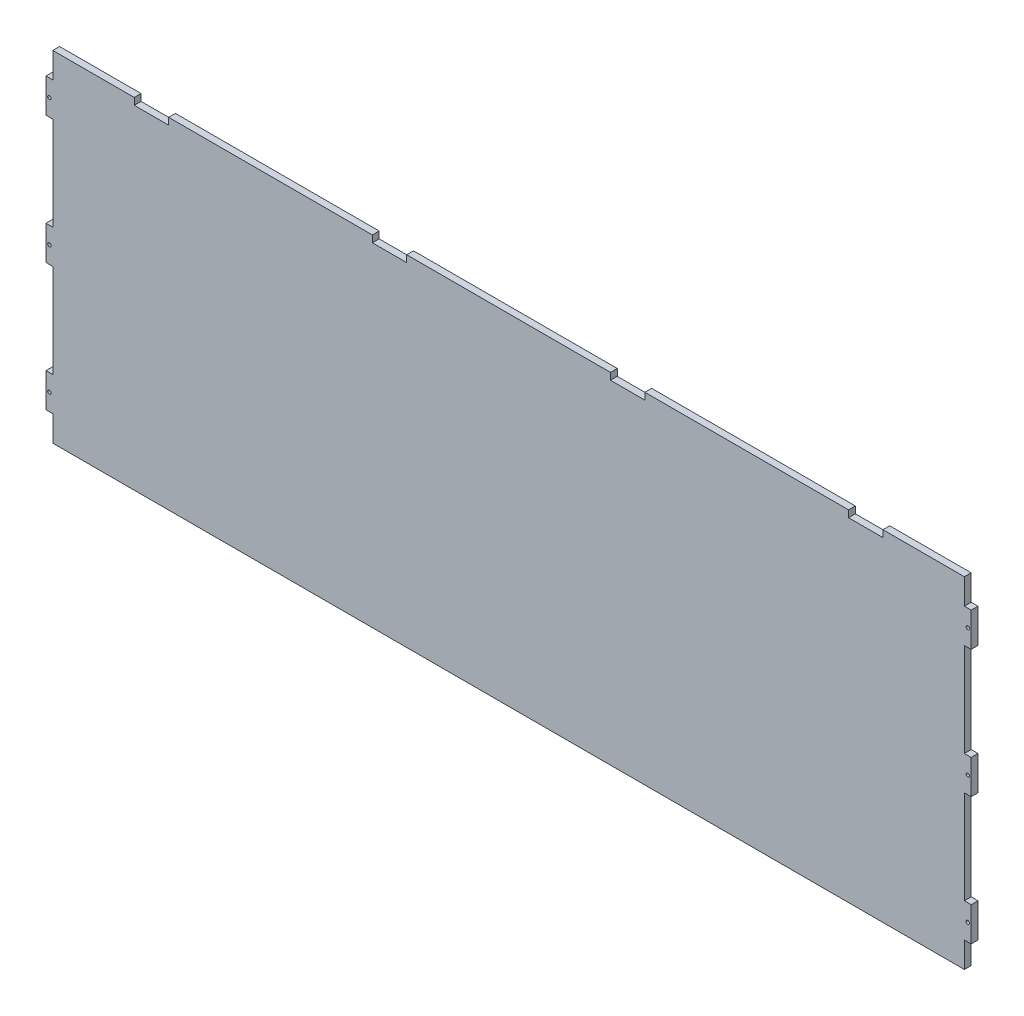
from build123d import *

# Parameters (mm, degrees)
SKIZZE1_W                       = 544
SKIZZE1_H                       = 200
AUFSATZ_LINEAR_AUSTRAGEN1_DEPTH = 4
SKIZZE2_W                       = 4
SKIZZE2_H                       = 15
SKIZZE2_H_2                     = 55
SCHNITT_LINEAR_AUSTRAGEN1_DEPTH = 290.827534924
SKIZZE3_W                       = 20.2
SKIZZE3_H                       = 4
SCHNITT_LINEAR_AUSTRAGEN2_DEPTH = 290.827534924
F_2_0_2_DURCHMESSER_BOHRUNG1_D  = 2


with BuildPart() as part:
    # Skizze1 → Aufsatz-Linear austragen1 (new body)
    with BuildSketch(Plane.XY):
        Rectangle(SKIZZE1_W, SKIZZE1_H)
    extrude(amount=AUFSATZ_LINEAR_AUSTRAGEN1_DEPTH)

    # Skizze2 → Schnitt-Linear austragen1 (cut, through all)
    with BuildSketch(Plane.XY.offset(4)):
        with Locations((270, 92.5)):
            Rectangle(SKIZZE2_W, SKIZZE2_H)
        with Locations((270, 37.5)):
            Rectangle(SKIZZE2_W, SKIZZE2_H_2)
        with Locations((270, -37.5)):
            Rectangle(SKIZZE2_W, SKIZZE2_H_2)
        with Locations((270, -92.5)):
            Rectangle(SKIZZE2_W, SKIZZE2_H)
    schnitt_linear_austragen1 = extrude(amount=-SCHNITT_LINEAR_AUSTRAGEN1_DEPTH, mode=Mode.SUBTRACT)

    # Spiegeln1: Schnitt-Linear austragen1 across plane
    add(schnitt_linear_austragen1.mirror(Plane(origin=(0, 0, 0), x_dir=(0, 0, 1), z_dir=(1, 0, 0))), mode=Mode.SUBTRACT)

    # Skizze3 → Schnitt-Linear austragen2 (cut, through all)
    with BuildSketch(Plane.XY.offset(4)):
        with Locations((-210, 98)):
            Rectangle(SKIZZE3_W, SKIZZE3_H)
        with Locations((-70, 98)):
            Rectangle(SKIZZE3_W, SKIZZE3_H)
        with Locations((70, 98)):
            Rectangle(SKIZZE3_W, SKIZZE3_H)
        with Locations((210, 98)):
            Rectangle(SKIZZE3_W, SKIZZE3_H)
    extrude(amount=-SCHNITT_LINEAR_AUSTRAGEN2_DEPTH, mode=Mode.SUBTRACT)

    # 2.0 _2_ Durchmesser Bohrung1 (through all)
    with Locations(Plane.XY.offset(4)):
        with Locations((-270, 75), (-270, 0), (-270, -75), (270, 75), (270, 0), (270, -75)):
            Hole(F_2_0_2_DURCHMESSER_BOHRUNG1_D / 2)


solid = part.part
